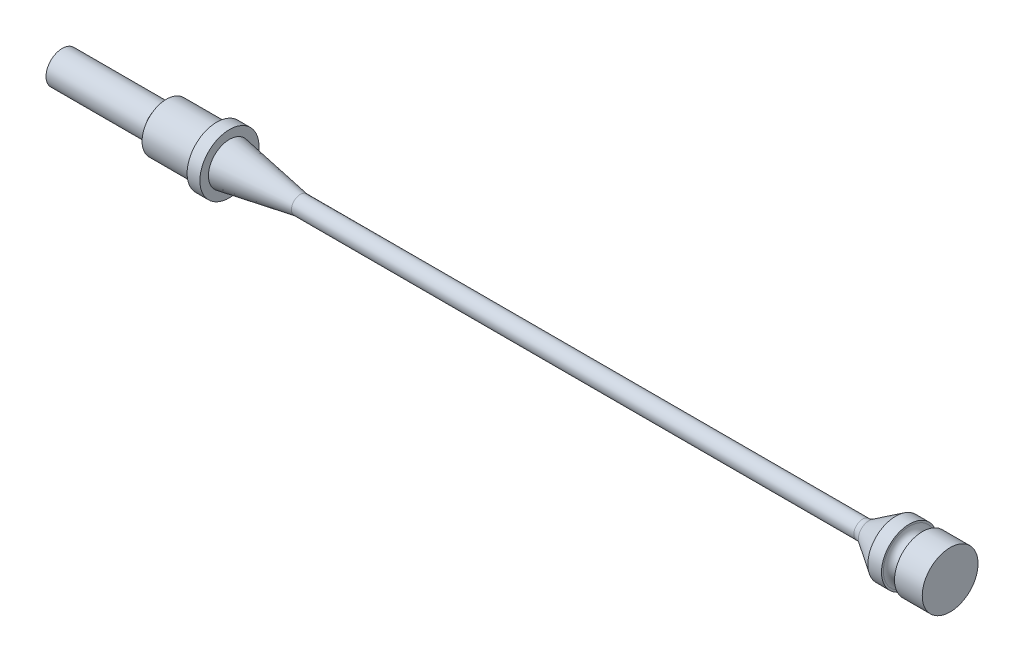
from build123d import *


with BuildPart() as part:
    # Sketch2 → Revolve2 (revolve)
    with BuildSketch(Plane.XY, mode=Mode.PRIVATE) as revolve2_sk:
        with BuildLine():
            Line((190.5, 0), (190.5, 5.98805))
            Line((190.5, 5.98805), (184.5564, 5.98805))
            Line((184.5564, 5.98805), (184.5564, 5.588))
            ThreePointArc((184.5564, 5.588), (183.1594, 4.191), (181.7624, 5.588))
            Line((181.7624, 5.588), (181.7624, 5.98805))
            Line((181.7624, 5.98805), (178.8287, 5.98805))
            Line((178.8287, 5.98805), (173.106298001, 2.308545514))
            ThreePointArc((173.106298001, 2.308545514), (172.448450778, 2.007973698), (171.732557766, 1.905))
            Line((171.732557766, 1.905), (51.082557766, 1.905))
            Line((51.082557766, 1.905), (35.8775, 4.51485))
            Line((35.8775, 4.51485), (35.8775, 6.35))
            Line((35.8775, 6.35), (33.1343, 6.35))
            Line((33.1343, 6.35), (33.1343, 5.22605))
            Line((33.1343, 5.22605), (22.352, 5.22605))
            Line((22.352, 5.22605), (21.082, 3.48615))
            Line((21.082, 3.48615), (0, 3.48615))
            Line((0, 3.48615), (0, 0))
            Line((0, 0), (190.5, 0))
        make_face()
    revolve(revolve2_sk.sketch.rotate(Axis((0, 0, 0), (1, 0, 0)), 90), axis=Axis((0, 0, 0), (1, 0, 0)))


solid = part.part
